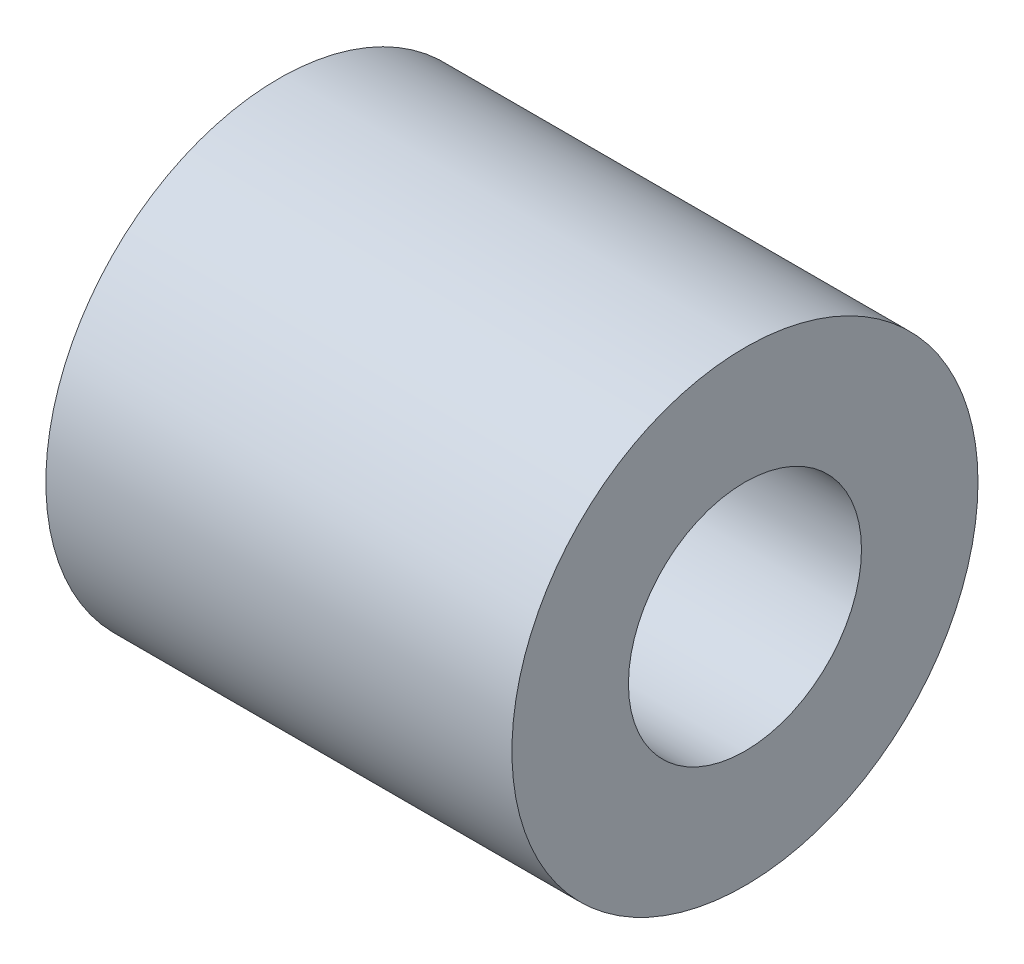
from build123d import *

# Parameters (mm, degrees)
SKETCH1_R           = 3.175
SKETCH1_R_2         = 1.5875
BOSS_EXTRUDE1_DEPTH = 6.35


with BuildPart() as part:
    # Sketch1 → Boss-Extrude1 (new body)
    with BuildSketch(Plane.YZ):
        with Locations(Location((0, 0, 0), (0, 0, 270))):
            Circle(SKETCH1_R)
        with Locations(Location((0, 0, 0), (0, 0, 270))):
            Circle(SKETCH1_R_2, mode=Mode.SUBTRACT)
    extrude(amount=BOSS_EXTRUDE1_DEPTH)


solid = part.part
